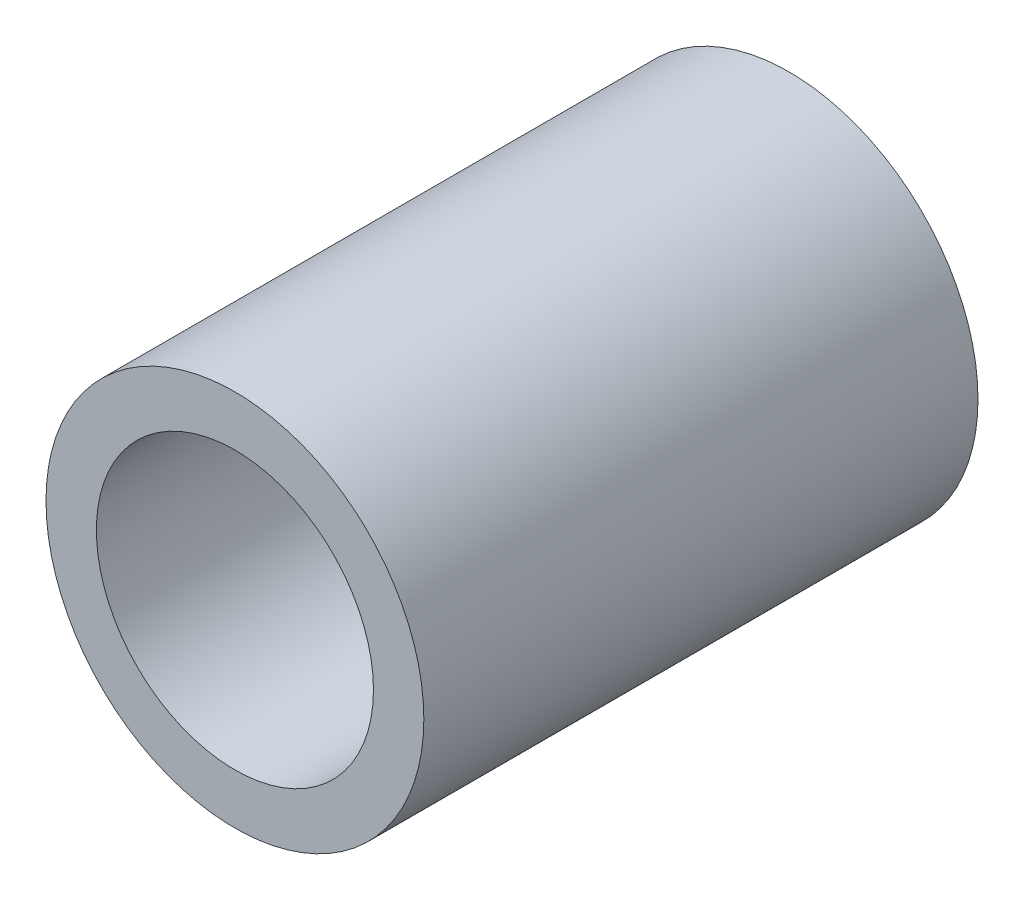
ISO-10303-21;
HEADER;
FILE_DESCRIPTION(('STEP AP214'),'2;1');
FILE_NAME('part.step','',(''),(''),'','','');
FILE_SCHEMA(('AUTOMOTIVE_DESIGN { 1 0 10303 214 1 1 1 1 }'));
ENDSEC;
DATA;
#1=APPLICATION_CONTEXT('core data for automotive mechanical design processes');
#2=APPLICATION_PROTOCOL_DEFINITION('international standard','automotive_design',2000,#1);
#3=PRODUCT_CONTEXT('',#1,'mechanical');
#4=PRODUCT('Part','Part','',(#3));
#5=PRODUCT_RELATED_PRODUCT_CATEGORY('part','',(#4));
#6=PRODUCT_DEFINITION_FORMATION('','',#4);
#7=PRODUCT_DEFINITION_CONTEXT('part definition',#1,'design');
#8=PRODUCT_DEFINITION('design','',#6,#7);
#9=PRODUCT_DEFINITION_SHAPE('','',#8);
#10=(LENGTH_UNIT() NAMED_UNIT(*) SI_UNIT(.MILLI.,.METRE.));
#11=(NAMED_UNIT(*) PLANE_ANGLE_UNIT() SI_UNIT($,.RADIAN.));
#12=(NAMED_UNIT(*) SI_UNIT($,.STERADIAN.) SOLID_ANGLE_UNIT());
#13=UNCERTAINTY_MEASURE_WITH_UNIT(LENGTH_MEASURE(1.E-05),#10,'distance_accuracy_value','');
#14=(GEOMETRIC_REPRESENTATION_CONTEXT(3) GLOBAL_UNCERTAINTY_ASSIGNED_CONTEXT((#13)) GLOBAL_UNIT_ASSIGNED_CONTEXT((#10,
#11,#12)) REPRESENTATION_CONTEXT('',''));
#15=CARTESIAN_POINT('',(0.,0.,0.));
#16=DIRECTION('',(0.,0.,1.));
#17=DIRECTION('',(1.,0.,0.));
#18=AXIS2_PLACEMENT_3D('',#15,#16,#17);
#19=CARTESIAN_POINT('',(0.,0.,0.));
#20=DIRECTION('',(0.,0.,1.));
#21=DIRECTION('',(1.,0.,0.));
#22=AXIS2_PLACEMENT_3D('',#19,#20,#21);
#23=CYLINDRICAL_SURFACE('',#22,2.75);
#24=CARTESIAN_POINT('',(0.,0.,0.));
#25=DIRECTION('',(0.,0.,1.));
#26=DIRECTION('',(1.,0.,0.));
#27=AXIS2_PLACEMENT_3D('',#24,#25,#26);
#28=CIRCLE('',#27,2.75);
#29=CARTESIAN_POINT('',(2.75,0.,0.));
#30=VERTEX_POINT('',#29);
#31=EDGE_CURVE('E26',#30,#30,#28,.T.);
#32=ORIENTED_EDGE('',*,*,#31,.F.);
#33=EDGE_LOOP('',(#32));
#34=FACE_BOUND('',#33,.T.);
#35=CARTESIAN_POINT('',(0.,0.,11.));
#36=DIRECTION('',(0.,0.,1.));
#37=DIRECTION('',(1.,0.,0.));
#38=AXIS2_PLACEMENT_3D('',#35,#36,#37);
#39=CIRCLE('',#38,2.75);
#40=CARTESIAN_POINT('',(2.75,0.,11.));
#41=VERTEX_POINT('',#40);
#42=EDGE_CURVE('E17',#41,#41,#39,.T.);
#43=ORIENTED_EDGE('',*,*,#42,.T.);
#44=EDGE_LOOP('',(#43));
#45=FACE_BOUND('',#44,.T.);
#46=ADVANCED_FACE('F14',(#34,#45),#23,.F.);
#47=CARTESIAN_POINT('',(0.,0.,11.));
#48=DIRECTION('',(0.,0.,-1.));
#49=DIRECTION('',(-1.,0.,0.));
#50=AXIS2_PLACEMENT_3D('',#47,#48,#49);
#51=PLANE('',#50);
#52=ORIENTED_EDGE('',*,*,#42,.F.);
#53=EDGE_LOOP('',(#52));
#54=FACE_BOUND('',#53,.T.);
#55=CARTESIAN_POINT('',(0.,0.,11.));
#56=DIRECTION('',(0.,0.,1.));
#57=DIRECTION('',(1.,0.,0.));
#58=AXIS2_PLACEMENT_3D('',#55,#56,#57);
#59=CIRCLE('',#58,3.75);
#60=CARTESIAN_POINT('',(3.75,0.,11.));
#61=VERTEX_POINT('',#60);
#62=EDGE_CURVE('E21',#61,#61,#59,.F.);
#63=ORIENTED_EDGE('',*,*,#62,.F.);
#64=EDGE_LOOP('',(#63));
#65=FACE_BOUND('',#64,.T.);
#66=ADVANCED_FACE('F35',(#54,#65),#51,.F.);
#67=CARTESIAN_POINT('',(0.,0.,0.));
#68=DIRECTION('',(0.,0.,-1.));
#69=DIRECTION('',(-1.,0.,0.));
#70=AXIS2_PLACEMENT_3D('',#67,#68,#69);
#71=PLANE('',#70);
#72=ORIENTED_EDGE('',*,*,#31,.T.);
#73=EDGE_LOOP('',(#72));
#74=FACE_BOUND('',#73,.T.);
#75=CARTESIAN_POINT('',(0.,0.,0.));
#76=DIRECTION('',(0.,0.,1.));
#77=DIRECTION('',(1.,0.,0.));
#78=AXIS2_PLACEMENT_3D('',#75,#76,#77);
#79=CIRCLE('',#78,3.75);
#80=CARTESIAN_POINT('',(3.75,0.,0.));
#81=VERTEX_POINT('',#80);
#82=EDGE_CURVE('E10',#81,#81,#79,.T.);
#83=ORIENTED_EDGE('',*,*,#82,.F.);
#84=EDGE_LOOP('',(#83));
#85=FACE_BOUND('',#84,.T.);
#86=ADVANCED_FACE('F38',(#74,#85),#71,.T.);
#87=CARTESIAN_POINT('',(0.,0.,0.));
#88=DIRECTION('',(0.,0.,1.));
#89=DIRECTION('',(1.,0.,0.));
#90=AXIS2_PLACEMENT_3D('',#87,#88,#89);
#91=CYLINDRICAL_SURFACE('',#90,3.75);
#92=ORIENTED_EDGE('',*,*,#82,.T.);
#93=EDGE_LOOP('',(#92));
#94=FACE_BOUND('',#93,.T.);
#95=ORIENTED_EDGE('',*,*,#62,.T.);
#96=EDGE_LOOP('',(#95));
#97=FACE_BOUND('',#96,.T.);
#98=ADVANCED_FACE('F41',(#94,#97),#91,.T.);
#99=CLOSED_SHELL('',(#46,#66,#86,#98));
#100=MANIFOLD_SOLID_BREP('B1',#99);
#101=ADVANCED_BREP_SHAPE_REPRESENTATION('',(#18,#100),#14);
#102=SHAPE_DEFINITION_REPRESENTATION(#9,#101);
ENDSEC;
END-ISO-10303-21;
